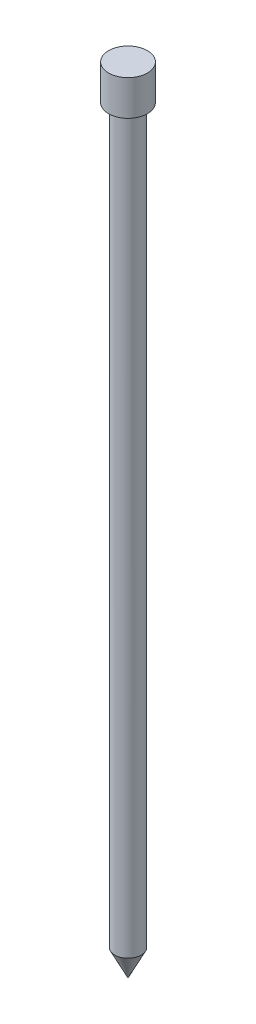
from build123d import *


with BuildPart() as part:
    # Sketch 1 → Revolve 1 (revolve)
    with BuildSketch(Plane.XY, mode=Mode.PRIVATE) as revolve_1_sk:
        Polygon((-0.75, 1.5), (0, 0), (0, 45), (-1.1, 45), (-1.1, 43), (-0.75, 43), align=None)
    revolve(revolve_1_sk.sketch.rotate(Axis((0, 0, 0), (0, 1, 0)), 270), axis=Axis((0, 0, 0), (0, 1, 0)))


solid = part.part
